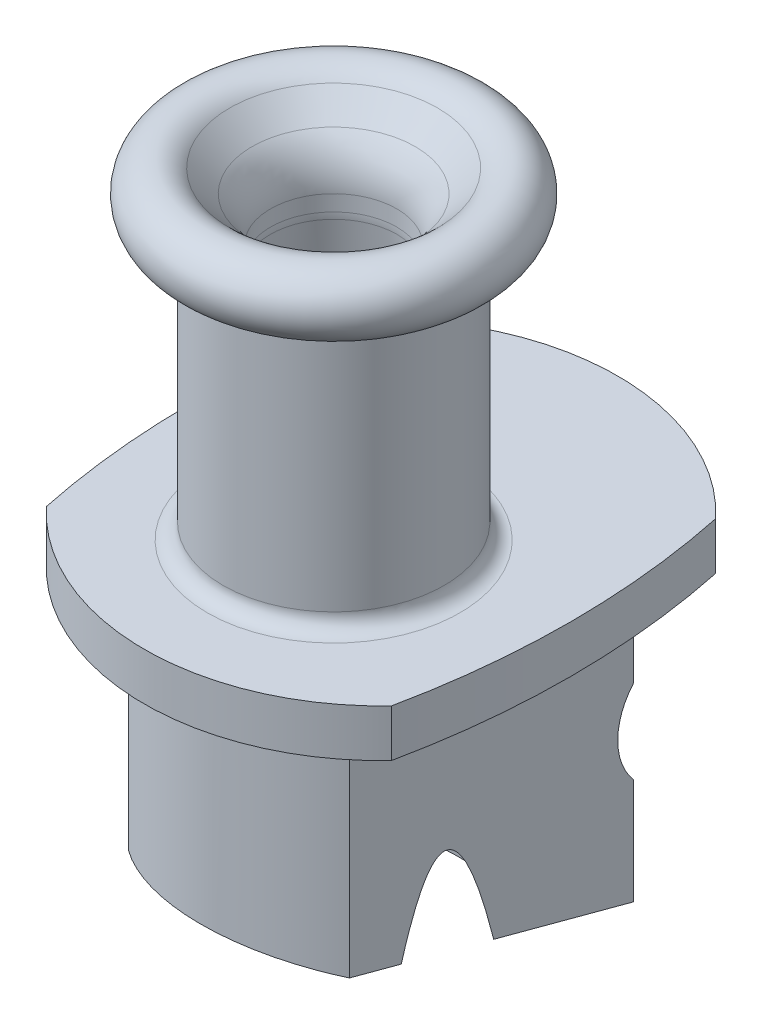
from build123d import *

# Parameters (mm, degrees)
SKETCH2_OUTSIDE_W  = 29.166
SKETCH2_OUTSIDE_H  = 29.166
CUT_EXTRUDE1_DEPTH = 19.227726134
SKETCH3_OUTSIDE_W  = 19.842
SKETCH3_OUTSIDE_H  = 22.842
CUT_EXTRUDE2_DEPTH = 17.155494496
SKETCH4_R          = 2
CUT_EXTRUDE3_DEPTH = 5
SKETCH5_R          = 1.25
CUT_EXTRUDE4_DEPTH = 23.374159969


with BuildPart() as part:
    # Sketch1 → Revolve1 (revolve)
    with BuildSketch(Plane.XY, mode=Mode.PRIVATE) as revolve1_sk:
        with BuildLine():
            Line((2, 0), (2, -0.5))
            ThreePointArc((2, -0.5), (2.00274093, -0.604671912), (2.010956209, -0.709056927))
            Line((2.010956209, -0.709056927), (3.994980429, -19.585786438))
            Line((3.994980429, -19.585786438), (8, -19.585786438))
            Line((8, -19.585786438), (8, -9.585786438))
            Line((8, -9.585786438), (10, -9.585786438))
            Line((10, -9.585786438), (10, -8.085786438))
            Line((10, -8.085786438), (4, -8.085786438))
            ThreePointArc((4, -8.085786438), (3.646446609, -7.939339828), (3.5, -7.585786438))
            Line((3.5, -7.585786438), (3.5, -0.085786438))
            ThreePointArc((3.5, -0.085786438), (3.646446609, 0.267766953), (4, 0.414213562))
            ThreePointArc((4, 0.414213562), (4.923879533, 1.796896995), (3.292893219, 2.121320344))
            Line((3.292893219, 2.121320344), (2.585786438, 1.414213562))
            ThreePointArc((2.585786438, 1.414213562), (2.152240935, 0.765366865), (2, 0))
        make_face()
    revolve(revolve1_sk.sketch.rotate(Axis((0, -19.635786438, 0), (0, 1, 0)), 90), axis=Axis((0, -19.635786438, 0), (0, 1, 0)))

    # Sketch2 outside → Cut-Extrude1 (cut, through all)
    with BuildSketch(Plane(origin=(0, -8.085786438, 0), x_dir=(-1, 0, 0), z_dir=(0, 1, 0))):
        Rectangle(SKETCH2_OUTSIDE_W, SKETCH2_OUTSIDE_H)
        with BuildLine():
            ThreePointArc((5.467105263, 3.634273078), (0, 6), (-5.467105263, 3.634273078))
            ThreePointArc((-5.467105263, 3.634273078), (-6, -1.5), (-5.467105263, -6.634273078))
            ThreePointArc((-5.467105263, -6.634273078), (0, -9), (5.467105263, -6.634273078))
            ThreePointArc((5.467105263, -6.634273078), (6, -1.5), (5.467105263, 3.634273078))
        make_face(mode=Mode.SUBTRACT)
    extrude(amount=-CUT_EXTRUDE1_DEPTH, mode=Mode.SUBTRACT)

    # Sketch3 outside → Cut-Extrude2 (cut, through all)
    with BuildSketch(Plane.XZ.offset(9.585786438)):
        with Locations((0, -1.5)):
            Rectangle(SKETCH3_OUTSIDE_W, SKETCH3_OUTSIDE_H)
        with BuildLine():
            Line((-3.5, -6), (-3.5, 3))
            ThreePointArc((-3.5, 3), (0, 4.200877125), (3.5, 3))
            Line((3.5, 3), (3.5, -6))
            ThreePointArc((3.5, -6), (0, -7.200877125), (-3.5, -6))
        make_face(mode=Mode.SUBTRACT)
    extrude(amount=CUT_EXTRUDE2_DEPTH, mode=Mode.SUBTRACT)

    # Sketch4 → Cut-Extrude3 (cut, symmetric)
    with BuildSketch(Plane(origin=(0, 0, 0), x_dir=(0, 0, -1), z_dir=(1, 0, 0))):
        with Locations((7.5, -14.585786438)):
            Circle(SKETCH4_R)
        Polygon((-4.200877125, -16.530695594), (7.200877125, -19.585786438), (-4.200877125, -19.585786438), align=None)
    extrude(amount=CUT_EXTRUDE3_DEPTH, both=True, mode=Mode.SUBTRACT)

    # Sketch5 → Cut-Extrude4 (cut, through all)
    with BuildSketch(Plane.XY):
        with Locations((0, -14.585786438)):
            Circle(SKETCH5_R)
    extrude(amount=-CUT_EXTRUDE4_DEPTH, mode=Mode.SUBTRACT)


solid = part.part
